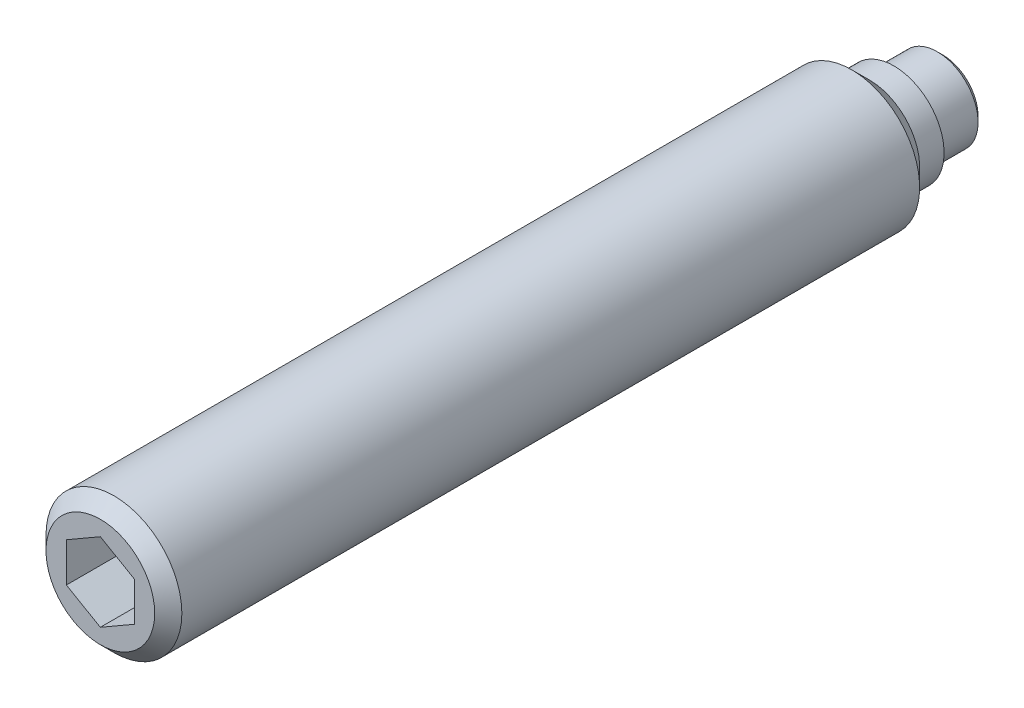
ISO-10303-21;
HEADER;
FILE_DESCRIPTION(('STEP AP214'),'2;1');
FILE_NAME('part.step','',(''),(''),'','','');
FILE_SCHEMA(('AUTOMOTIVE_DESIGN { 1 0 10303 214 1 1 1 1 }'));
ENDSEC;
DATA;
#1=APPLICATION_CONTEXT('core data for automotive mechanical design processes');
#2=APPLICATION_PROTOCOL_DEFINITION('international standard','automotive_design',2000,#1);
#3=PRODUCT_CONTEXT('',#1,'mechanical');
#4=PRODUCT('Part','Part','',(#3));
#5=PRODUCT_RELATED_PRODUCT_CATEGORY('part','',(#4));
#6=PRODUCT_DEFINITION_FORMATION('','',#4);
#7=PRODUCT_DEFINITION_CONTEXT('part definition',#1,'design');
#8=PRODUCT_DEFINITION('design','',#6,#7);
#9=PRODUCT_DEFINITION_SHAPE('','',#8);
#10=(LENGTH_UNIT() NAMED_UNIT(*) SI_UNIT(.MILLI.,.METRE.));
#11=(NAMED_UNIT(*) PLANE_ANGLE_UNIT() SI_UNIT($,.RADIAN.));
#12=(NAMED_UNIT(*) SI_UNIT($,.STERADIAN.) SOLID_ANGLE_UNIT());
#13=UNCERTAINTY_MEASURE_WITH_UNIT(LENGTH_MEASURE(1.E-05),#10,'distance_accuracy_value','');
#14=(GEOMETRIC_REPRESENTATION_CONTEXT(3) GLOBAL_UNCERTAINTY_ASSIGNED_CONTEXT((#13)) GLOBAL_UNIT_ASSIGNED_CONTEXT((#10,
#11,#12)) REPRESENTATION_CONTEXT('',''));
#15=CARTESIAN_POINT('',(0.,0.,0.));
#16=DIRECTION('',(0.,0.,1.));
#17=DIRECTION('',(1.,0.,0.));
#18=AXIS2_PLACEMENT_3D('',#15,#16,#17);
#19=CARTESIAN_POINT('',(0.,0.,1.8));
#20=DIRECTION('',(0.,0.,-1.));
#21=DIRECTION('',(-1.,0.,0.));
#22=AXIS2_PLACEMENT_3D('',#19,#20,#21);
#23=CYLINDRICAL_SURFACE('',#22,2.5);
#24=CARTESIAN_POINT('',(0.,0.,3.35));
#25=DIRECTION('',(0.,0.,-1.));
#26=DIRECTION('',(-1.,0.,0.));
#27=AXIS2_PLACEMENT_3D('',#24,#25,#26);
#28=CIRCLE('',#27,2.5);
#29=CARTESIAN_POINT('',(-2.5,0.,3.35));
#30=VERTEX_POINT('',#29);
#31=EDGE_CURVE('E9',#30,#30,#28,.T.);
#32=ORIENTED_EDGE('',*,*,#31,.F.);
#33=EDGE_LOOP('',(#32));
#34=FACE_BOUND('',#33,.T.);
#35=CARTESIAN_POINT('',(0.,0.,30.5));
#36=DIRECTION('',(0.,0.,1.));
#37=DIRECTION('',(1.,0.,0.));
#38=AXIS2_PLACEMENT_3D('',#35,#36,#37);
#39=CIRCLE('',#38,2.5);
#40=CARTESIAN_POINT('',(2.5,0.,30.5));
#41=VERTEX_POINT('',#40);
#42=EDGE_CURVE('E123',#41,#41,#39,.T.);
#43=ORIENTED_EDGE('',*,*,#42,.F.);
#44=EDGE_LOOP('',(#43));
#45=FACE_BOUND('',#44,.T.);
#46=ADVANCED_FACE('F14',(#34,#45),#23,.T.);
#47=CARTESIAN_POINT('',(0.,0.,3.35));
#48=DIRECTION('',(0.,0.,1.));
#49=DIRECTION('',(1.,0.,0.));
#50=AXIS2_PLACEMENT_3D('',#47,#48,#49);
#51=CONICAL_SURFACE('',#50,2.5,0.785398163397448);
#52=ORIENTED_EDGE('',*,*,#31,.T.);
#53=EDGE_LOOP('',(#52));
#54=FACE_BOUND('',#53,.T.);
#55=CARTESIAN_POINT('',(0.,0.,2.7));
#56=DIRECTION('',(0.,0.,-1.));
#57=DIRECTION('',(-1.,0.,0.));
#58=AXIS2_PLACEMENT_3D('',#55,#56,#57);
#59=CIRCLE('',#58,1.85);
#60=CARTESIAN_POINT('',(-1.85,0.,2.7));
#61=VERTEX_POINT('',#60);
#62=EDGE_CURVE('E21',#61,#61,#59,.T.);
#63=ORIENTED_EDGE('',*,*,#62,.F.);
#64=EDGE_LOOP('',(#63));
#65=FACE_BOUND('',#64,.T.);
#66=ADVANCED_FACE('F143',(#54,#65),#51,.T.);
#67=CARTESIAN_POINT('',(0.,0.,1.8));
#68=DIRECTION('',(0.,0.,-1.));
#69=DIRECTION('',(-1.,0.,0.));
#70=AXIS2_PLACEMENT_3D('',#67,#68,#69);
#71=CYLINDRICAL_SURFACE('',#70,1.85);
#72=ORIENTED_EDGE('',*,*,#62,.T.);
#73=EDGE_LOOP('',(#72));
#74=FACE_BOUND('',#73,.T.);
#75=CARTESIAN_POINT('',(0.,0.,1.8));
#76=DIRECTION('',(0.,0.,-1.));
#77=DIRECTION('',(-1.,0.,0.));
#78=AXIS2_PLACEMENT_3D('',#75,#76,#77);
#79=CIRCLE('',#78,1.85);
#80=CARTESIAN_POINT('',(-1.85,0.,1.8));
#81=VERTEX_POINT('',#80);
#82=EDGE_CURVE('E135',#81,#81,#79,.T.);
#83=ORIENTED_EDGE('',*,*,#82,.F.);
#84=EDGE_LOOP('',(#83));
#85=FACE_BOUND('',#84,.T.);
#86=ADVANCED_FACE('F140',(#74,#85),#71,.T.);
#87=CARTESIAN_POINT('',(0.,1.85,1.8));
#88=DIRECTION('',(0.,0.,1.));
#89=DIRECTION('',(1.,0.,0.));
#90=AXIS2_PLACEMENT_3D('',#87,#88,#89);
#91=PLANE('',#90);
#92=ORIENTED_EDGE('',*,*,#82,.T.);
#93=EDGE_LOOP('',(#92));
#94=FACE_BOUND('',#93,.T.);
#95=CARTESIAN_POINT('',(0.,0.,1.8));
#96=DIRECTION('',(0.,0.,-1.));
#97=DIRECTION('',(-1.,0.,0.));
#98=AXIS2_PLACEMENT_3D('',#95,#96,#97);
#99=CIRCLE('',#98,1.5);
#100=CARTESIAN_POINT('',(-1.5,0.,1.8));
#101=VERTEX_POINT('',#100);
#102=EDGE_CURVE('E132',#101,#101,#99,.T.);
#103=ORIENTED_EDGE('',*,*,#102,.F.);
#104=EDGE_LOOP('',(#103));
#105=FACE_BOUND('',#104,.T.);
#106=ADVANCED_FACE('F151',(#94,#105),#91,.F.);
#107=CARTESIAN_POINT('',(0.,0.,0.));
#108=DIRECTION('',(0.,0.,-1.));
#109=DIRECTION('',(-1.,0.,0.));
#110=AXIS2_PLACEMENT_3D('',#107,#108,#109);
#111=CYLINDRICAL_SURFACE('',#110,1.5);
#112=CARTESIAN_POINT('',(0.,0.,0.2));
#113=DIRECTION('',(0.,0.,-1.));
#114=DIRECTION('',(-1.,0.,0.));
#115=AXIS2_PLACEMENT_3D('',#112,#113,#114);
#116=CIRCLE('',#115,1.5);
#117=CARTESIAN_POINT('',(-1.5,0.,0.2));
#118=VERTEX_POINT('',#117);
#119=EDGE_CURVE('E129',#118,#118,#116,.T.);
#120=ORIENTED_EDGE('',*,*,#119,.F.);
#121=EDGE_LOOP('',(#120));
#122=FACE_BOUND('',#121,.T.);
#123=ORIENTED_EDGE('',*,*,#102,.T.);
#124=EDGE_LOOP('',(#123));
#125=FACE_BOUND('',#124,.T.);
#126=ADVANCED_FACE('F157',(#122,#125),#111,.T.);
#127=CARTESIAN_POINT('',(0.,0.,0.2));
#128=DIRECTION('',(0.,0.,1.));
#129=DIRECTION('',(1.,0.,0.));
#130=AXIS2_PLACEMENT_3D('',#127,#128,#129);
#131=CONICAL_SURFACE('',#130,1.5,0.785398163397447);
#132=CARTESIAN_POINT('',(0.,0.,0.));
#133=DIRECTION('',(0.,0.,-1.));
#134=DIRECTION('',(-1.,0.,0.));
#135=AXIS2_PLACEMENT_3D('',#132,#133,#134);
#136=CIRCLE('',#135,1.3);
#137=CARTESIAN_POINT('',(-1.3,0.,0.));
#138=VERTEX_POINT('',#137);
#139=EDGE_CURVE('E126',#138,#138,#136,.T.);
#140=ORIENTED_EDGE('',*,*,#139,.F.);
#141=EDGE_LOOP('',(#140));
#142=FACE_BOUND('',#141,.T.);
#143=ORIENTED_EDGE('',*,*,#119,.T.);
#144=EDGE_LOOP('',(#143));
#145=FACE_BOUND('',#144,.T.);
#146=ADVANCED_FACE('F161',(#142,#145),#131,.T.);
#147=CARTESIAN_POINT('',(0.,1.3,0.));
#148=DIRECTION('',(0.,0.,1.));
#149=DIRECTION('',(1.,0.,0.));
#150=AXIS2_PLACEMENT_3D('',#147,#148,#149);
#151=PLANE('',#150);
#152=ORIENTED_EDGE('',*,*,#139,.T.);
#153=EDGE_LOOP('',(#152));
#154=FACE_BOUND('',#153,.T.);
#155=ADVANCED_FACE('F165',(#154),#151,.F.);
#156=CARTESIAN_POINT('',(0.,0.,31.));
#157=DIRECTION('',(0.,0.,-1.));
#158=DIRECTION('',(-1.,0.,0.));
#159=AXIS2_PLACEMENT_3D('',#156,#157,#158);
#160=CONICAL_SURFACE('',#159,2.,0.785398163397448);
#161=ORIENTED_EDGE('',*,*,#42,.T.);
#162=EDGE_LOOP('',(#161));
#163=FACE_BOUND('',#162,.T.);
#164=CARTESIAN_POINT('',(0.,0.,31.));
#165=DIRECTION('',(0.,0.,1.));
#166=DIRECTION('',(1.,0.,0.));
#167=AXIS2_PLACEMENT_3D('',#164,#165,#166);
#168=CIRCLE('',#167,2.);
#169=CARTESIAN_POINT('',(2.,0.,31.));
#170=VERTEX_POINT('',#169);
#171=EDGE_CURVE('E115',#170,#170,#168,.T.);
#172=ORIENTED_EDGE('',*,*,#171,.F.);
#173=EDGE_LOOP('',(#172));
#174=FACE_BOUND('',#173,.T.);
#175=ADVANCED_FACE('F169',(#163,#174),#160,.T.);
#176=CARTESIAN_POINT('',(0.,-2.,31.));
#177=DIRECTION('',(0.,0.,1.));
#178=DIRECTION('',(1.,0.,0.));
#179=AXIS2_PLACEMENT_3D('',#176,#177,#178);
#180=PLANE('',#179);
#181=DIRECTION('',(0.866025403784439,-0.5,0.));
#182=VECTOR('',#181,1.);
#183=CARTESIAN_POINT('',(-1.25,-0.721687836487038,31.));
#184=LINE('',#183,#182);
#185=CARTESIAN_POINT('',(-1.25,-0.721687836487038,31.));
#186=VERTEX_POINT('',#185);
#187=CARTESIAN_POINT('',(0.,-1.44337567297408,31.));
#188=VERTEX_POINT('',#187);
#189=EDGE_CURVE('E28',#186,#188,#184,.T.);
#190=ORIENTED_EDGE('',*,*,#189,.F.);
#191=DIRECTION('',(0.,-1.,0.));
#192=VECTOR('',#191,1.);
#193=CARTESIAN_POINT('',(-1.25,0.721687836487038,31.));
#194=LINE('',#193,#192);
#195=CARTESIAN_POINT('',(-1.25,0.721687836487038,31.));
#196=VERTEX_POINT('',#195);
#197=EDGE_CURVE('E111',#196,#186,#194,.T.);
#198=ORIENTED_EDGE('',*,*,#197,.F.);
#199=DIRECTION('',(-0.866025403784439,-0.5,0.));
#200=VECTOR('',#199,1.);
#201=CARTESIAN_POINT('',(0.,1.44337567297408,31.));
#202=LINE('',#201,#200);
#203=CARTESIAN_POINT('',(0.,1.44337567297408,31.));
#204=VERTEX_POINT('',#203);
#205=EDGE_CURVE('E109',#204,#196,#202,.T.);
#206=ORIENTED_EDGE('',*,*,#205,.F.);
#207=DIRECTION('',(-0.866025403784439,0.5,0.));
#208=VECTOR('',#207,1.);
#209=CARTESIAN_POINT('',(1.25,0.721687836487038,31.));
#210=LINE('',#209,#208);
#211=CARTESIAN_POINT('',(1.25,0.721687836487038,31.));
#212=VERTEX_POINT('',#211);
#213=EDGE_CURVE('E76',#212,#204,#210,.T.);
#214=ORIENTED_EDGE('',*,*,#213,.F.);
#215=DIRECTION('',(0.,1.,0.));
#216=VECTOR('',#215,1.);
#217=CARTESIAN_POINT('',(1.25,-0.721687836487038,31.));
#218=LINE('',#217,#216);
#219=CARTESIAN_POINT('',(1.25,-0.721687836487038,31.));
#220=VERTEX_POINT('',#219);
#221=EDGE_CURVE('E105',#220,#212,#218,.T.);
#222=ORIENTED_EDGE('',*,*,#221,.F.);
#223=DIRECTION('',(0.866025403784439,0.5,0.));
#224=VECTOR('',#223,1.);
#225=CARTESIAN_POINT('',(0.,-1.44337567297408,31.));
#226=LINE('',#225,#224);
#227=EDGE_CURVE('E102',#188,#220,#226,.T.);
#228=ORIENTED_EDGE('',*,*,#227,.F.);
#229=EDGE_LOOP('',(#190,#198,#206,#214,#222,#228));
#230=FACE_BOUND('',#229,.T.);
#231=ORIENTED_EDGE('',*,*,#171,.T.);
#232=EDGE_LOOP('',(#231));
#233=FACE_BOUND('',#232,.T.);
#234=ADVANCED_FACE('F173',(#230,#233),#180,.T.);
#235=CARTESIAN_POINT('',(-1.25,-0.721687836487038,28.));
#236=DIRECTION('',(-0.5,-0.866025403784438,0.));
#237=DIRECTION('',(0.866025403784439,-0.5,0.));
#238=AXIS2_PLACEMENT_3D('',#235,#236,#237);
#239=PLANE('',#238);
#240=ORIENTED_EDGE('',*,*,#189,.T.);
#241=DIRECTION('',(0.,0.,1.));
#242=VECTOR('',#241,1.);
#243=CARTESIAN_POINT('',(0.,-1.44337567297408,28.));
#244=LINE('',#243,#242);
#245=CARTESIAN_POINT('',(0.,-1.44337567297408,28.));
#246=VERTEX_POINT('',#245);
#247=EDGE_CURVE('E58',#246,#188,#244,.T.);
#248=ORIENTED_EDGE('',*,*,#247,.F.);
#249=DIRECTION('',(0.866025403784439,-0.5,0.));
#250=VECTOR('',#249,1.);
#251=CARTESIAN_POINT('',(-1.25,-0.721687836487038,28.));
#252=LINE('',#251,#250);
#253=CARTESIAN_POINT('',(-1.25,-0.721687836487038,28.));
#254=VERTEX_POINT('',#253);
#255=EDGE_CURVE('E113',#254,#246,#252,.T.);
#256=ORIENTED_EDGE('',*,*,#255,.F.);
#257=DIRECTION('',(0.,0.,1.));
#258=VECTOR('',#257,1.);
#259=CARTESIAN_POINT('',(-1.25,-0.721687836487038,28.));
#260=LINE('',#259,#258);
#261=EDGE_CURVE('E36',#254,#186,#260,.T.);
#262=ORIENTED_EDGE('',*,*,#261,.T.);
#263=EDGE_LOOP('',(#240,#248,#256,#262));
#264=FACE_BOUND('',#263,.T.);
#265=ADVANCED_FACE('F177',(#264),#239,.F.);
#266=CARTESIAN_POINT('',(-1.25,0.721687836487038,28.));
#267=DIRECTION('',(-1.,0.,0.));
#268=DIRECTION('',(0.,0.,1.));
#269=AXIS2_PLACEMENT_3D('',#266,#267,#268);
#270=PLANE('',#269);
#271=ORIENTED_EDGE('',*,*,#197,.T.);
#272=ORIENTED_EDGE('',*,*,#261,.F.);
#273=DIRECTION('',(0.,-1.,0.));
#274=VECTOR('',#273,1.);
#275=CARTESIAN_POINT('',(-1.25,0.721687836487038,28.));
#276=LINE('',#275,#274);
#277=CARTESIAN_POINT('',(-1.25,0.721687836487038,28.));
#278=VERTEX_POINT('',#277);
#279=EDGE_CURVE('E88',#278,#254,#276,.T.);
#280=ORIENTED_EDGE('',*,*,#279,.F.);
#281=DIRECTION('',(0.,0.,1.));
#282=VECTOR('',#281,1.);
#283=CARTESIAN_POINT('',(-1.25,0.721687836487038,28.));
#284=LINE('',#283,#282);
#285=EDGE_CURVE('E80',#278,#196,#284,.T.);
#286=ORIENTED_EDGE('',*,*,#285,.T.);
#287=EDGE_LOOP('',(#271,#272,#280,#286));
#288=FACE_BOUND('',#287,.T.);
#289=ADVANCED_FACE('F181',(#288),#270,.F.);
#290=CARTESIAN_POINT('',(0.,1.44337567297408,28.));
#291=DIRECTION('',(-0.5,0.866025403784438,0.));
#292=DIRECTION('',(-0.866025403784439,-0.5,0.));
#293=AXIS2_PLACEMENT_3D('',#290,#291,#292);
#294=PLANE('',#293);
#295=ORIENTED_EDGE('',*,*,#205,.T.);
#296=ORIENTED_EDGE('',*,*,#285,.F.);
#297=DIRECTION('',(-0.866025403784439,-0.5,0.));
#298=VECTOR('',#297,1.);
#299=CARTESIAN_POINT('',(0.,1.44337567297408,28.));
#300=LINE('',#299,#298);
#301=CARTESIAN_POINT('',(0.,1.44337567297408,28.));
#302=VERTEX_POINT('',#301);
#303=EDGE_CURVE('E84',#302,#278,#300,.T.);
#304=ORIENTED_EDGE('',*,*,#303,.F.);
#305=DIRECTION('',(0.,0.,1.));
#306=VECTOR('',#305,1.);
#307=CARTESIAN_POINT('',(0.,1.44337567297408,28.));
#308=LINE('',#307,#306);
#309=EDGE_CURVE('E69',#302,#204,#308,.T.);
#310=ORIENTED_EDGE('',*,*,#309,.T.);
#311=EDGE_LOOP('',(#295,#296,#304,#310));
#312=FACE_BOUND('',#311,.T.);
#313=ADVANCED_FACE('F85',(#312),#294,.F.);
#314=CARTESIAN_POINT('',(1.25,0.721687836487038,28.));
#315=DIRECTION('',(0.5,0.866025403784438,0.));
#316=DIRECTION('',(-0.866025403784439,0.5,0.));
#317=AXIS2_PLACEMENT_3D('',#314,#315,#316);
#318=PLANE('',#317);
#319=ORIENTED_EDGE('',*,*,#213,.T.);
#320=ORIENTED_EDGE('',*,*,#309,.F.);
#321=DIRECTION('',(-0.866025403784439,0.5,0.));
#322=VECTOR('',#321,1.);
#323=CARTESIAN_POINT('',(1.25,0.721687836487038,28.));
#324=LINE('',#323,#322);
#325=CARTESIAN_POINT('',(1.25,0.721687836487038,28.));
#326=VERTEX_POINT('',#325);
#327=EDGE_CURVE('E73',#326,#302,#324,.T.);
#328=ORIENTED_EDGE('',*,*,#327,.F.);
#329=DIRECTION('',(0.,0.,1.));
#330=VECTOR('',#329,1.);
#331=CARTESIAN_POINT('',(1.25,0.721687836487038,28.));
#332=LINE('',#331,#330);
#333=EDGE_CURVE('E81',#326,#212,#332,.T.);
#334=ORIENTED_EDGE('',*,*,#333,.T.);
#335=EDGE_LOOP('',(#319,#320,#328,#334));
#336=FACE_BOUND('',#335,.T.);
#337=ADVANCED_FACE('F71',(#336),#318,.F.);
#338=CARTESIAN_POINT('',(1.25,-0.721687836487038,28.));
#339=DIRECTION('',(1.,0.,0.));
#340=DIRECTION('',(0.,0.,-1.));
#341=AXIS2_PLACEMENT_3D('',#338,#339,#340);
#342=PLANE('',#341);
#343=ORIENTED_EDGE('',*,*,#221,.T.);
#344=ORIENTED_EDGE('',*,*,#333,.F.);
#345=DIRECTION('',(0.,1.,0.));
#346=VECTOR('',#345,1.);
#347=CARTESIAN_POINT('',(1.25,-0.721687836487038,28.));
#348=LINE('',#347,#346);
#349=CARTESIAN_POINT('',(1.25,-0.721687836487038,28.));
#350=VERTEX_POINT('',#349);
#351=EDGE_CURVE('E94',#350,#326,#348,.T.);
#352=ORIENTED_EDGE('',*,*,#351,.F.);
#353=DIRECTION('',(0.,0.,1.));
#354=VECTOR('',#353,1.);
#355=CARTESIAN_POINT('',(1.25,-0.721687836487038,28.));
#356=LINE('',#355,#354);
#357=EDGE_CURVE('E118',#350,#220,#356,.T.);
#358=ORIENTED_EDGE('',*,*,#357,.T.);
#359=EDGE_LOOP('',(#343,#344,#352,#358));
#360=FACE_BOUND('',#359,.T.);
#361=ADVANCED_FACE('F185',(#360),#342,.F.);
#362=CARTESIAN_POINT('',(0.,-1.44337567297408,28.));
#363=DIRECTION('',(0.5,-0.866025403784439,0.));
#364=DIRECTION('',(0.866025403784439,0.5,0.));
#365=AXIS2_PLACEMENT_3D('',#362,#363,#364);
#366=PLANE('',#365);
#367=ORIENTED_EDGE('',*,*,#227,.T.);
#368=ORIENTED_EDGE('',*,*,#357,.F.);
#369=DIRECTION('',(0.866025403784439,0.5,0.));
#370=VECTOR('',#369,1.);
#371=CARTESIAN_POINT('',(0.,-1.44337567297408,28.));
#372=LINE('',#371,#370);
#373=EDGE_CURVE('E96',#246,#350,#372,.T.);
#374=ORIENTED_EDGE('',*,*,#373,.F.);
#375=ORIENTED_EDGE('',*,*,#247,.T.);
#376=EDGE_LOOP('',(#367,#368,#374,#375));
#377=FACE_BOUND('',#376,.T.);
#378=ADVANCED_FACE('F182',(#377),#366,.F.);
#379=CARTESIAN_POINT('',(0.,0.,28.));
#380=DIRECTION('',(0.,0.,1.));
#381=DIRECTION('',(1.,0.,0.));
#382=AXIS2_PLACEMENT_3D('',#379,#380,#381);
#383=PLANE('',#382);
#384=ORIENTED_EDGE('',*,*,#255,.T.);
#385=ORIENTED_EDGE('',*,*,#373,.T.);
#386=ORIENTED_EDGE('',*,*,#351,.T.);
#387=ORIENTED_EDGE('',*,*,#327,.T.);
#388=ORIENTED_EDGE('',*,*,#303,.T.);
#389=ORIENTED_EDGE('',*,*,#279,.T.);
#390=EDGE_LOOP('',(#384,#385,#386,#387,#388,#389));
#391=FACE_BOUND('',#390,.T.);
#392=ADVANCED_FACE('F91',(#391),#383,.T.);
#393=CLOSED_SHELL('',(#46,#66,#86,#106,#126,#146,#155,#175,#234,#265,#289,#313,#337,#361,#378,#392));
#394=MANIFOLD_SOLID_BREP('B1',#393);
#395=ADVANCED_BREP_SHAPE_REPRESENTATION('',(#18,#394),#14);
#396=SHAPE_DEFINITION_REPRESENTATION(#9,#395);
ENDSEC;
END-ISO-10303-21;
